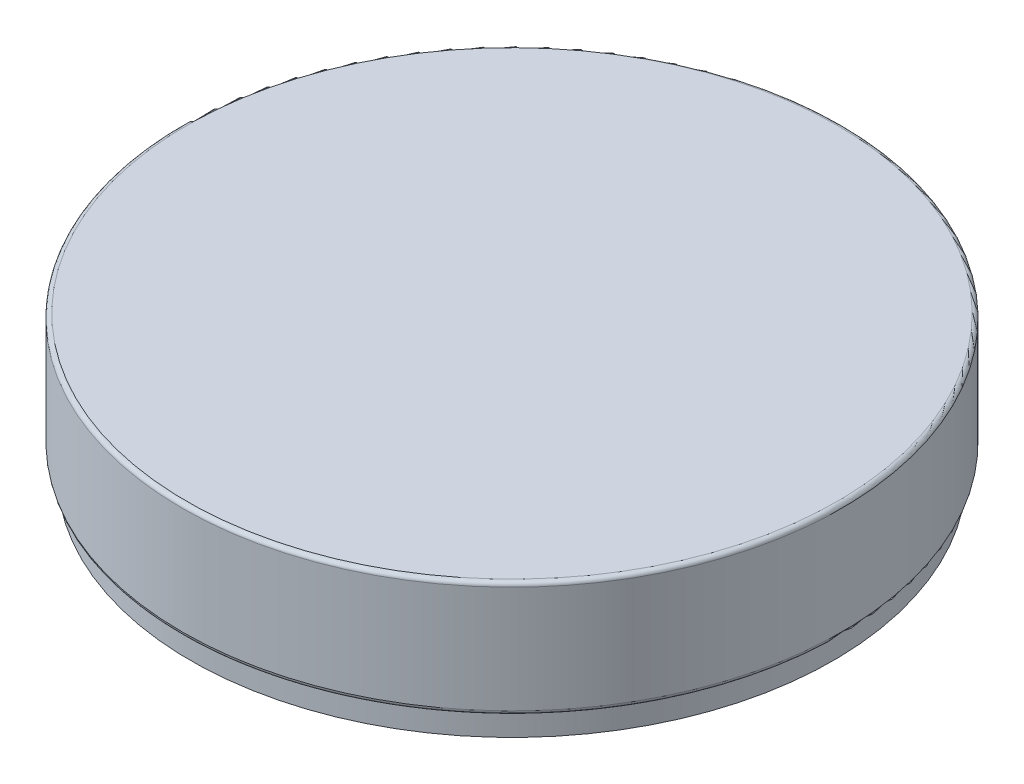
ISO-10303-21;
HEADER;
FILE_DESCRIPTION(('STEP AP214'),'2;1');
FILE_NAME('part.step','',(''),(''),'','','');
FILE_SCHEMA(('AUTOMOTIVE_DESIGN { 1 0 10303 214 1 1 1 1 }'));
ENDSEC;
DATA;
#1=APPLICATION_CONTEXT('core data for automotive mechanical design processes');
#2=APPLICATION_PROTOCOL_DEFINITION('international standard','automotive_design',2000,#1);
#3=PRODUCT_CONTEXT('',#1,'mechanical');
#4=PRODUCT('Part','Part','',(#3));
#5=PRODUCT_RELATED_PRODUCT_CATEGORY('part','',(#4));
#6=PRODUCT_DEFINITION_FORMATION('','',#4);
#7=PRODUCT_DEFINITION_CONTEXT('part definition',#1,'design');
#8=PRODUCT_DEFINITION('design','',#6,#7);
#9=PRODUCT_DEFINITION_SHAPE('','',#8);
#10=(LENGTH_UNIT() NAMED_UNIT(*) SI_UNIT(.MILLI.,.METRE.));
#11=(NAMED_UNIT(*) PLANE_ANGLE_UNIT() SI_UNIT($,.RADIAN.));
#12=(NAMED_UNIT(*) SI_UNIT($,.STERADIAN.) SOLID_ANGLE_UNIT());
#13=UNCERTAINTY_MEASURE_WITH_UNIT(LENGTH_MEASURE(1.E-05),#10,'distance_accuracy_value','');
#14=(GEOMETRIC_REPRESENTATION_CONTEXT(3) GLOBAL_UNCERTAINTY_ASSIGNED_CONTEXT((#13)) GLOBAL_UNIT_ASSIGNED_CONTEXT((#10,
#11,#12)) REPRESENTATION_CONTEXT('',''));
#15=CARTESIAN_POINT('',(0.,0.,0.));
#16=DIRECTION('',(0.,0.,1.));
#17=DIRECTION('',(1.,0.,0.));
#18=AXIS2_PLACEMENT_3D('',#15,#16,#17);
#19=CARTESIAN_POINT('',(0.,17.5,0.));
#20=DIRECTION('',(0.,-1.,0.));
#21=DIRECTION('',(0.,0.,-1.));
#22=AXIS2_PLACEMENT_3D('',#19,#20,#21);
#23=TOROIDAL_SURFACE('',#22,197.5,2.5);
#24=CARTESIAN_POINT('',(0.,15.,0.));
#25=DIRECTION('',(0.,-1.,0.));
#26=DIRECTION('',(0.,0.,-1.));
#27=AXIS2_PLACEMENT_3D('',#24,#25,#26);
#28=CIRCLE('',#27,197.5);
#29=CARTESIAN_POINT('',(0.,15.,-197.5));
#30=VERTEX_POINT('',#29);
#31=EDGE_CURVE('E66',#30,#30,#28,.T.);
#32=ORIENTED_EDGE('',*,*,#31,.F.);
#33=EDGE_LOOP('',(#32));
#34=FACE_BOUND('',#33,.T.);
#35=CARTESIAN_POINT('',(0.,17.5,0.));
#36=DIRECTION('',(0.,-1.,0.));
#37=DIRECTION('',(0.,0.,-1.));
#38=AXIS2_PLACEMENT_3D('',#35,#36,#37);
#39=CIRCLE('',#38,200.);
#40=CARTESIAN_POINT('',(0.,17.5,-200.));
#41=VERTEX_POINT('',#40);
#42=EDGE_CURVE('E10',#41,#41,#39,.T.);
#43=ORIENTED_EDGE('',*,*,#42,.T.);
#44=EDGE_LOOP('',(#43));
#45=FACE_BOUND('',#44,.T.);
#46=ADVANCED_FACE('F39',(#34,#45),#23,.T.);
#47=CARTESIAN_POINT('',(0.,-14.3064536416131,0.));
#48=DIRECTION('',(0.,-1.,0.));
#49=DIRECTION('',(0.,0.,-1.));
#50=AXIS2_PLACEMENT_3D('',#47,#48,#49);
#51=CYLINDRICAL_SURFACE('',#50,200.);
#52=ORIENTED_EDGE('',*,*,#42,.F.);
#53=EDGE_LOOP('',(#52));
#54=FACE_BOUND('',#53,.T.);
#55=CARTESIAN_POINT('',(0.,82.5,0.));
#56=DIRECTION('',(0.,-1.,0.));
#57=DIRECTION('',(0.,0.,-1.));
#58=AXIS2_PLACEMENT_3D('',#55,#56,#57);
#59=CIRCLE('',#58,200.);
#60=CARTESIAN_POINT('',(0.,82.5,-200.));
#61=VERTEX_POINT('',#60);
#62=EDGE_CURVE('E46',#61,#61,#59,.T.);
#63=ORIENTED_EDGE('',*,*,#62,.T.);
#64=EDGE_LOOP('',(#63));
#65=FACE_BOUND('',#64,.T.);
#66=ADVANCED_FACE('F105',(#54,#65),#51,.T.);
#67=CARTESIAN_POINT('',(0.,82.5,0.));
#68=DIRECTION('',(0.,-1.,0.));
#69=DIRECTION('',(0.,0.,-1.));
#70=AXIS2_PLACEMENT_3D('',#67,#68,#69);
#71=TOROIDAL_SURFACE('',#70,197.5,2.5);
#72=ORIENTED_EDGE('',*,*,#62,.F.);
#73=EDGE_LOOP('',(#72));
#74=FACE_BOUND('',#73,.T.);
#75=CARTESIAN_POINT('',(0.,85.,0.));
#76=DIRECTION('',(0.,-1.,0.));
#77=DIRECTION('',(0.,0.,-1.));
#78=AXIS2_PLACEMENT_3D('',#75,#76,#77);
#79=CIRCLE('',#78,197.5);
#80=CARTESIAN_POINT('',(0.,85.,-197.5));
#81=VERTEX_POINT('',#80);
#82=EDGE_CURVE('E51',#81,#81,#79,.T.);
#83=ORIENTED_EDGE('',*,*,#82,.T.);
#84=EDGE_LOOP('',(#83));
#85=FACE_BOUND('',#84,.T.);
#86=ADVANCED_FACE('F110',(#74,#85),#71,.T.);
#87=CARTESIAN_POINT('',(0.,85.,0.));
#88=DIRECTION('',(0.,-1.,0.));
#89=DIRECTION('',(0.,0.,-1.));
#90=AXIS2_PLACEMENT_3D('',#87,#88,#89);
#91=PLANE('',#90);
#92=ORIENTED_EDGE('',*,*,#82,.F.);
#93=EDGE_LOOP('',(#92));
#94=FACE_BOUND('',#93,.T.);
#95=ADVANCED_FACE('F92',(#94),#91,.F.);
#96=CARTESIAN_POINT('',(0.,0.,0.));
#97=DIRECTION('',(0.,-1.,0.));
#98=DIRECTION('',(0.,0.,-1.));
#99=AXIS2_PLACEMENT_3D('',#96,#97,#98);
#100=PLANE('',#99);
#101=CARTESIAN_POINT('',(0.,0.,0.));
#102=DIRECTION('',(0.,-1.,0.));
#103=DIRECTION('',(0.,0.,-1.));
#104=AXIS2_PLACEMENT_3D('',#101,#102,#103);
#105=CIRCLE('',#104,190.);
#106=CARTESIAN_POINT('',(0.,0.,-190.));
#107=VERTEX_POINT('',#106);
#108=EDGE_CURVE('E71',#107,#107,#105,.T.);
#109=ORIENTED_EDGE('',*,*,#108,.F.);
#110=EDGE_LOOP('',(#109));
#111=FACE_BOUND('',#110,.T.);
#112=CARTESIAN_POINT('',(0.,0.,0.));
#113=DIRECTION('',(0.,-1.,0.));
#114=DIRECTION('',(0.,0.,-1.));
#115=AXIS2_PLACEMENT_3D('',#112,#113,#114);
#116=CIRCLE('',#115,195.);
#117=CARTESIAN_POINT('',(0.,0.,-195.));
#118=VERTEX_POINT('',#117);
#119=EDGE_CURVE('E56',#118,#118,#116,.T.);
#120=ORIENTED_EDGE('',*,*,#119,.T.);
#121=EDGE_LOOP('',(#120));
#122=FACE_BOUND('',#121,.T.);
#123=ADVANCED_FACE('F88',(#111,#122),#100,.T.);
#124=CARTESIAN_POINT('',(0.,-14.3064536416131,0.));
#125=DIRECTION('',(0.,-1.,0.));
#126=DIRECTION('',(0.,0.,-1.));
#127=AXIS2_PLACEMENT_3D('',#124,#125,#126);
#128=CYLINDRICAL_SURFACE('',#127,195.);
#129=CARTESIAN_POINT('',(0.,15.,0.));
#130=DIRECTION('',(0.,-1.,0.));
#131=DIRECTION('',(0.,0.,-1.));
#132=AXIS2_PLACEMENT_3D('',#129,#130,#131);
#133=CIRCLE('',#132,195.);
#134=CARTESIAN_POINT('',(0.,15.,-195.));
#135=VERTEX_POINT('',#134);
#136=EDGE_CURVE('E62',#135,#135,#133,.T.);
#137=ORIENTED_EDGE('',*,*,#136,.T.);
#138=EDGE_LOOP('',(#137));
#139=FACE_BOUND('',#138,.T.);
#140=ORIENTED_EDGE('',*,*,#119,.F.);
#141=EDGE_LOOP('',(#140));
#142=FACE_BOUND('',#141,.T.);
#143=ADVANCED_FACE('F91',(#139,#142),#128,.T.);
#144=CARTESIAN_POINT('',(0.,15.,0.));
#145=DIRECTION('',(0.,1.,0.));
#146=DIRECTION('',(0.,0.,1.));
#147=AXIS2_PLACEMENT_3D('',#144,#145,#146);
#148=PLANE('',#147);
#149=ORIENTED_EDGE('',*,*,#136,.F.);
#150=EDGE_LOOP('',(#149));
#151=FACE_BOUND('',#150,.T.);
#152=ORIENTED_EDGE('',*,*,#31,.T.);
#153=EDGE_LOOP('',(#152));
#154=FACE_BOUND('',#153,.T.);
#155=ADVANCED_FACE('F84',(#151,#154),#148,.F.);
#156=CARTESIAN_POINT('',(0.,10.,0.));
#157=DIRECTION('',(0.,-1.,0.));
#158=DIRECTION('',(0.,0.,-1.));
#159=AXIS2_PLACEMENT_3D('',#156,#157,#158);
#160=CYLINDRICAL_SURFACE('',#159,190.);
#161=CARTESIAN_POINT('',(0.,10.,0.));
#162=DIRECTION('',(0.,-1.,0.));
#163=DIRECTION('',(0.,0.,-1.));
#164=AXIS2_PLACEMENT_3D('',#161,#162,#163);
#165=CIRCLE('',#164,190.);
#166=CARTESIAN_POINT('',(0.,10.,-190.));
#167=VERTEX_POINT('',#166);
#168=EDGE_CURVE('E70',#167,#167,#165,.T.);
#169=ORIENTED_EDGE('',*,*,#168,.F.);
#170=EDGE_LOOP('',(#169));
#171=FACE_BOUND('',#170,.T.);
#172=ORIENTED_EDGE('',*,*,#108,.T.);
#173=EDGE_LOOP('',(#172));
#174=FACE_BOUND('',#173,.T.);
#175=ADVANCED_FACE('F81',(#171,#174),#160,.F.);
#176=CARTESIAN_POINT('',(0.,10.,0.));
#177=DIRECTION('',(0.,-1.,0.));
#178=DIRECTION('',(0.,0.,-1.));
#179=AXIS2_PLACEMENT_3D('',#176,#177,#178);
#180=PLANE('',#179);
#181=ORIENTED_EDGE('',*,*,#168,.T.);
#182=EDGE_LOOP('',(#181));
#183=FACE_BOUND('',#182,.T.);
#184=ADVANCED_FACE('F79',(#183),#180,.T.);
#185=CLOSED_SHELL('',(#46,#66,#86,#95,#123,#143,#155,#175,#184));
#186=MANIFOLD_SOLID_BREP('B2',#185);
#187=ADVANCED_BREP_SHAPE_REPRESENTATION('',(#18,#186),#14);
#188=SHAPE_DEFINITION_REPRESENTATION(#9,#187);
ENDSEC;
END-ISO-10303-21;
